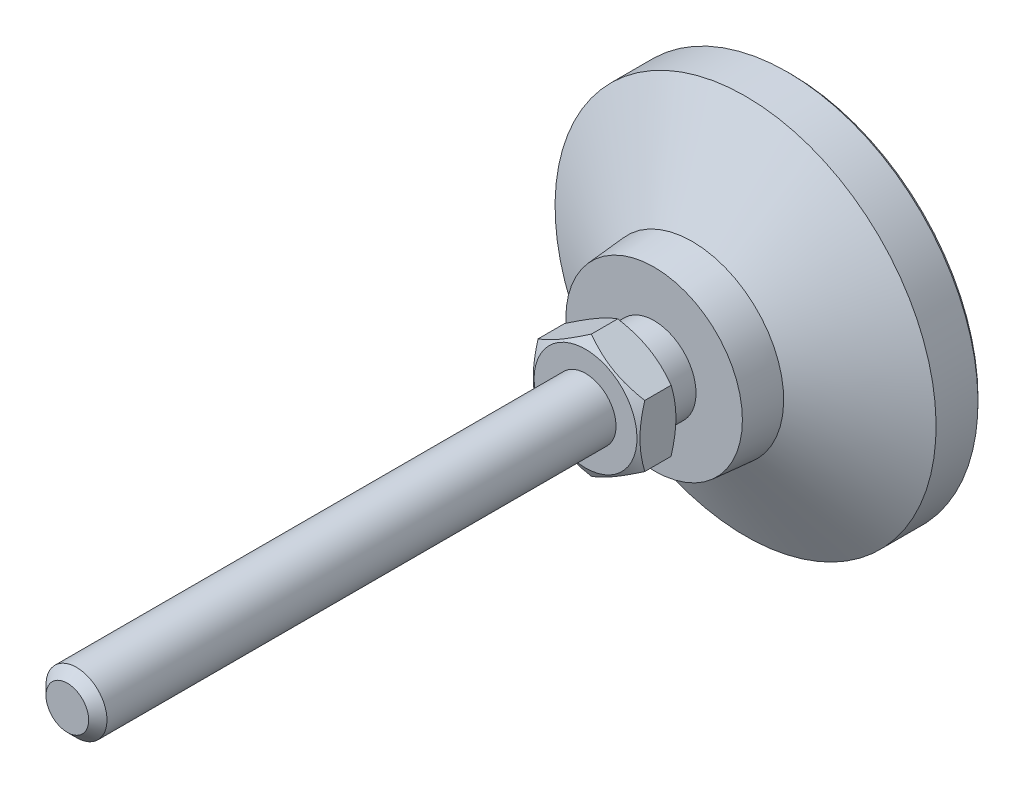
ISO-10303-21;
HEADER;
FILE_DESCRIPTION(('STEP AP214'),'2;1');
FILE_NAME('part.step','',(''),(''),'','','');
FILE_SCHEMA(('AUTOMOTIVE_DESIGN { 1 0 10303 214 1 1 1 1 }'));
ENDSEC;
DATA;
#1=APPLICATION_CONTEXT('core data for automotive mechanical design processes');
#2=APPLICATION_PROTOCOL_DEFINITION('international standard','automotive_design',2000,#1);
#3=PRODUCT_CONTEXT('',#1,'mechanical');
#4=PRODUCT('Part','Part','',(#3));
#5=PRODUCT_RELATED_PRODUCT_CATEGORY('part','',(#4));
#6=PRODUCT_DEFINITION_FORMATION('','',#4);
#7=PRODUCT_DEFINITION_CONTEXT('part definition',#1,'design');
#8=PRODUCT_DEFINITION('design','',#6,#7);
#9=PRODUCT_DEFINITION_SHAPE('','',#8);
#10=(LENGTH_UNIT() NAMED_UNIT(*) SI_UNIT(.MILLI.,.METRE.));
#11=(NAMED_UNIT(*) PLANE_ANGLE_UNIT() SI_UNIT($,.RADIAN.));
#12=(NAMED_UNIT(*) SI_UNIT($,.STERADIAN.) SOLID_ANGLE_UNIT());
#13=UNCERTAINTY_MEASURE_WITH_UNIT(LENGTH_MEASURE(1.E-05),#10,'distance_accuracy_value','');
#14=(GEOMETRIC_REPRESENTATION_CONTEXT(3) GLOBAL_UNCERTAINTY_ASSIGNED_CONTEXT((#13)) GLOBAL_UNIT_ASSIGNED_CONTEXT((#10,
#11,#12)) REPRESENTATION_CONTEXT('',''));
#15=CARTESIAN_POINT('',(0.,0.,0.));
#16=DIRECTION('',(0.,0.,1.));
#17=DIRECTION('',(1.,0.,0.));
#18=AXIS2_PLACEMENT_3D('',#15,#16,#17);
#19=CARTESIAN_POINT('',(0.,0.,-1.));
#20=DIRECTION('',(0.,0.,-1.));
#21=DIRECTION('',(0.,1.,0.));
#22=AXIS2_PLACEMENT_3D('',#19,#20,#21);
#23=CYLINDRICAL_SURFACE('',#22,5.49999999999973);
#24=CARTESIAN_POINT('',(0.,0.,22.));
#25=DIRECTION('',(0.,0.,-1.));
#26=DIRECTION('',(0.,1.,0.));
#27=AXIS2_PLACEMENT_3D('',#24,#25,#26);
#28=CIRCLE('',#27,5.49999999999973);
#29=CARTESIAN_POINT('',(0.,5.49999999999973,22.));
#30=VERTEX_POINT('',#29);
#31=EDGE_CURVE('E100',#30,#30,#28,.T.);
#32=ORIENTED_EDGE('',*,*,#31,.T.);
#33=EDGE_LOOP('',(#32));
#34=FACE_BOUND('',#33,.T.);
#35=CARTESIAN_POINT('',(0.,0.,18.));
#36=DIRECTION('',(0.,0.,-1.));
#37=DIRECTION('',(0.,1.,0.));
#38=AXIS2_PLACEMENT_3D('',#35,#36,#37);
#39=CIRCLE('',#38,5.49999999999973);
#40=CARTESIAN_POINT('',(0.,5.49999999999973,18.));
#41=VERTEX_POINT('',#40);
#42=EDGE_CURVE('E93',#41,#41,#39,.T.);
#43=ORIENTED_EDGE('',*,*,#42,.F.);
#44=EDGE_LOOP('',(#43));
#45=FACE_BOUND('',#44,.T.);
#46=ADVANCED_FACE('F14',(#34,#45),#23,.T.);
#47=CARTESIAN_POINT('',(-5.49999999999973,0.,22.));
#48=DIRECTION('',(0.,0.,1.));
#49=DIRECTION('',(0.,-1.,0.));
#50=AXIS2_PLACEMENT_3D('',#47,#48,#49);
#51=PLANE('',#50);
#52=CARTESIAN_POINT('',(0.,0.,22.));
#53=DIRECTION('',(0.,0.,1.));
#54=DIRECTION('',(0.,-1.,0.));
#55=AXIS2_PLACEMENT_3D('',#52,#53,#54);
#56=CIRCLE('',#55,6.75);
#57=CARTESIAN_POINT('',(0.,-6.75,22.));
#58=VERTEX_POINT('',#57);
#59=EDGE_CURVE('E417',#58,#58,#56,.T.);
#60=ORIENTED_EDGE('',*,*,#59,.F.);
#61=EDGE_LOOP('',(#60));
#62=FACE_BOUND('',#61,.T.);
#63=ORIENTED_EDGE('',*,*,#31,.F.);
#64=EDGE_LOOP('',(#63));
#65=FACE_BOUND('',#64,.T.);
#66=ADVANCED_FACE('F133',(#62,#65),#51,.F.);
#67=CARTESIAN_POINT('',(0.,-5.49999999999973,18.));
#68=DIRECTION('',(0.,0.,1.));
#69=DIRECTION('',(0.,-1.,0.));
#70=AXIS2_PLACEMENT_3D('',#67,#68,#69);
#71=PLANE('',#70);
#72=ORIENTED_EDGE('',*,*,#42,.T.);
#73=EDGE_LOOP('',(#72));
#74=FACE_BOUND('',#73,.T.);
#75=CARTESIAN_POINT('',(0.,0.,18.));
#76=DIRECTION('',(0.,0.,1.));
#77=DIRECTION('',(0.,-1.,0.));
#78=AXIS2_PLACEMENT_3D('',#75,#76,#77);
#79=CIRCLE('',#78,11.5833333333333);
#80=CARTESIAN_POINT('',(0.,-11.5833333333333,18.));
#81=VERTEX_POINT('',#80);
#82=EDGE_CURVE('E88',#81,#81,#79,.T.);
#83=ORIENTED_EDGE('',*,*,#82,.T.);
#84=EDGE_LOOP('',(#83));
#85=FACE_BOUND('',#84,.T.);
#86=ADVANCED_FACE('F124',(#74,#85),#71,.T.);
#87=CARTESIAN_POINT('',(0.,0.,0.));
#88=DIRECTION('',(0.,0.,-1.));
#89=DIRECTION('',(0.,1.,0.));
#90=AXIS2_PLACEMENT_3D('',#87,#88,#89);
#91=PLANE('',#90);
#92=CARTESIAN_POINT('',(0.,0.,0.));
#93=DIRECTION('',(0.,0.,-1.));
#94=DIRECTION('',(0.,1.,0.));
#95=AXIS2_PLACEMENT_3D('',#92,#93,#94);
#96=CIRCLE('',#95,24.5);
#97=CARTESIAN_POINT('',(0.,24.5,0.));
#98=VERTEX_POINT('',#97);
#99=EDGE_CURVE('E108',#98,#98,#96,.T.);
#100=ORIENTED_EDGE('',*,*,#99,.T.);
#101=EDGE_LOOP('',(#100));
#102=FACE_BOUND('',#101,.T.);
#103=ADVANCED_FACE('F122',(#102),#91,.T.);
#104=CARTESIAN_POINT('',(0.,0.,-1.));
#105=DIRECTION('',(0.,0.,-1.));
#106=DIRECTION('',(0.,1.,0.));
#107=AXIS2_PLACEMENT_3D('',#104,#105,#106);
#108=CYLINDRICAL_SURFACE('',#107,25.);
#109=CARTESIAN_POINT('',(0.,0.,0.500000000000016));
#110=DIRECTION('',(0.,0.,-1.));
#111=DIRECTION('',(0.,1.,0.));
#112=AXIS2_PLACEMENT_3D('',#109,#110,#111);
#113=CIRCLE('',#112,25.);
#114=CARTESIAN_POINT('',(0.,25.,0.500000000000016));
#115=VERTEX_POINT('',#114);
#116=EDGE_CURVE('E28',#115,#115,#113,.F.);
#117=ORIENTED_EDGE('',*,*,#116,.T.);
#118=EDGE_LOOP('',(#117));
#119=FACE_BOUND('',#118,.T.);
#120=CARTESIAN_POINT('',(0.,0.,6.00000000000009));
#121=DIRECTION('',(0.,0.,-1.));
#122=DIRECTION('',(0.,1.,0.));
#123=AXIS2_PLACEMENT_3D('',#120,#121,#122);
#124=CIRCLE('',#123,25.);
#125=CARTESIAN_POINT('',(0.,25.,6.00000000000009));
#126=VERTEX_POINT('',#125);
#127=EDGE_CURVE('E106',#126,#126,#124,.T.);
#128=ORIENTED_EDGE('',*,*,#127,.T.);
#129=EDGE_LOOP('',(#128));
#130=FACE_BOUND('',#129,.T.);
#131=ADVANCED_FACE('F114',(#119,#130),#108,.T.);
#132=CARTESIAN_POINT('',(0.,0.,13.));
#133=DIRECTION('',(0.,0.,-1.));
#134=DIRECTION('',(0.,1.,0.));
#135=AXIS2_PLACEMENT_3D('',#132,#133,#134);
#136=CONICAL_SURFACE('',#135,12.,1.07685495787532);
#137=ORIENTED_EDGE('',*,*,#127,.F.);
#138=EDGE_LOOP('',(#137));
#139=FACE_BOUND('',#138,.T.);
#140=CARTESIAN_POINT('',(0.,0.,13.));
#141=DIRECTION('',(0.,0.,-1.));
#142=DIRECTION('',(0.,1.,0.));
#143=AXIS2_PLACEMENT_3D('',#140,#141,#142);
#144=CIRCLE('',#143,12.);
#145=CARTESIAN_POINT('',(0.,12.,13.));
#146=VERTEX_POINT('',#145);
#147=EDGE_CURVE('E103',#146,#146,#144,.T.);
#148=ORIENTED_EDGE('',*,*,#147,.T.);
#149=EDGE_LOOP('',(#148));
#150=FACE_BOUND('',#149,.T.);
#151=ADVANCED_FACE('F132',(#139,#150),#136,.T.);
#152=CARTESIAN_POINT('',(0.,0.,19.));
#153=DIRECTION('',(0.,0.,-1.));
#154=DIRECTION('',(0.,1.,0.));
#155=AXIS2_PLACEMENT_3D('',#152,#153,#154);
#156=CONICAL_SURFACE('',#155,11.5,0.0831412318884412);
#157=ORIENTED_EDGE('',*,*,#147,.F.);
#158=EDGE_LOOP('',(#157));
#159=FACE_BOUND('',#158,.T.);
#160=ORIENTED_EDGE('',*,*,#82,.F.);
#161=EDGE_LOOP('',(#160));
#162=FACE_BOUND('',#161,.T.);
#163=ADVANCED_FACE('F119',(#159,#162),#156,.T.);
#164=CARTESIAN_POINT('',(0.,0.,0.));
#165=DIRECTION('',(0.,0.,1.));
#166=DIRECTION('',(0.,-1.,0.));
#167=AXIS2_PLACEMENT_3D('',#164,#165,#166);
#168=CONICAL_SURFACE('',#167,24.5,0.785398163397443);
#169=ORIENTED_EDGE('',*,*,#116,.F.);
#170=EDGE_LOOP('',(#169));
#171=FACE_BOUND('',#170,.T.);
#172=ORIENTED_EDGE('',*,*,#99,.F.);
#173=EDGE_LOOP('',(#172));
#174=FACE_BOUND('',#173,.T.);
#175=ADVANCED_FACE('F16',(#171,#174),#168,.T.);
#176=CARTESIAN_POINT('',(0.,0.,22.));
#177=DIRECTION('',(0.,0.,1.));
#178=DIRECTION('',(0.,-1.,0.));
#179=AXIS2_PLACEMENT_3D('',#176,#177,#178);
#180=CONICAL_SURFACE('',#179,6.75,1.0471975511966);
#181=CARTESIAN_POINT('',(0.000200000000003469,-8.0830192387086,22.7696190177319));
#182=CARTESIAN_POINT('',(-0.15366790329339,-7.99418356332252,22.7183374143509));
#183=CARTESIAN_POINT('',(-0.308109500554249,-7.90501666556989,22.669383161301));
#184=CARTESIAN_POINT('',(-0.618246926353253,-7.72595873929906,22.5767703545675));
#185=CARTESIAN_POINT('',(-0.773943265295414,-7.63606741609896,22.5331140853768));
#186=CARTESIAN_POINT('',(-1.24352516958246,-7.36495417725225,22.4109491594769));
#187=CARTESIAN_POINT('',(-1.5592643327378,-7.18266208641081,22.3414631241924));
#188=CARTESIAN_POINT('',(-2.03176224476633,-6.90986528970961,22.2599825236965));
#189=CARTESIAN_POINT('',(-2.18710922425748,-6.82017566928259,22.2367710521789));
#190=CARTESIAN_POINT('',(-2.49850511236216,-6.64039116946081,22.1978487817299));
#191=CARTESIAN_POINT('',(-2.65455395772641,-6.55029632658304,22.1821373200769));
#192=CARTESIAN_POINT('',(-2.96692267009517,-6.36995016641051,22.1586154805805));
#193=CARTESIAN_POINT('',(-3.12324202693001,-6.27969914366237,22.1507961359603));
#194=CARTESIAN_POINT('',(-3.43601650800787,-6.09911871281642,22.1432178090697));
#195=CARTESIAN_POINT('',(-3.59247162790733,-6.00878930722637,22.1434585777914));
#196=CARTESIAN_POINT('',(-4.02110687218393,-5.76131663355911,22.155197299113));
#197=CARTESIAN_POINT('',(-4.2931466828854,-5.60425437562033,22.1749033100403));
#198=CARTESIAN_POINT('',(-4.83541944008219,-5.29117305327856,22.2373910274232));
#199=CARTESIAN_POINT('',(-5.10565047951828,-5.13515508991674,22.2801940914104));
#200=CARTESIAN_POINT('',(-5.64901454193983,-4.82144370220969,22.3871892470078));
#201=CARTESIAN_POINT('',(-5.92207900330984,-4.6637898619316,22.4518346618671));
#202=CARTESIAN_POINT('',(-6.46413578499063,-4.35083323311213,22.5985536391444));
#203=CARTESIAN_POINT('',(-6.73313504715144,-4.19552643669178,22.680592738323));
#204=CARTESIAN_POINT('',(-7.0002,-4.04133641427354,22.7696190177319));
#205=B_SPLINE_CURVE_WITH_KNOTS('',3,(#181,#182,#183,#184,#185,#186,#187,#188,#189,#190,#191,
#192,#193,#194,#195,#196,#197,#198,#199,#200,#201,#202,#203,#204),.UNSPECIFIED.,.F.,.F.,(4,2,2,
2,2,2,2,2,2,2,2,4),(0.,0.554727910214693,1.10969417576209,2.2219327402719,2.76443041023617,
3.30688013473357,3.8487128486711,4.39052882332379,5.33376515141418,6.27787517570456,
7.2429241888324,8.20607866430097),.UNSPECIFIED.);
#206=CARTESIAN_POINT('',(0.,-8.08290376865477,22.7695523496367));
#207=VERTEX_POINT('',#206);
#208=CARTESIAN_POINT('',(-7.,-4.04145188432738,22.7695523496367));
#209=VERTEX_POINT('',#208);
#210=EDGE_CURVE('E73',#207,#209,#205,.T.);
#211=ORIENTED_EDGE('',*,*,#210,.T.);
#212=CARTESIAN_POINT('',(-7.,10.8083509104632,25.5374995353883));
#213=CARTESIAN_POINT('',(-7.,10.5030085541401,25.3895726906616));
#214=CARTESIAN_POINT('',(-7.,10.1969601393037,25.2430780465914));
#215=CARTESIAN_POINT('',(-7.,9.58307551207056,24.9537596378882));
#216=CARTESIAN_POINT('',(-7.,9.27523902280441,24.8109364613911));
#217=CARTESIAN_POINT('',(-7.,8.65579360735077,24.5290387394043));
#218=CARTESIAN_POINT('',(-7.,8.3441732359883,24.3899892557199));
#219=CARTESIAN_POINT('',(-7.,7.71843731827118,24.1176445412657));
#220=CARTESIAN_POINT('',(-7.,7.40432189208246,23.9843490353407));
#221=CARTESIAN_POINT('',(-7.,6.76314461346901,23.720944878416));
#222=CARTESIAN_POINT('',(-7.,6.4359866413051,23.5910688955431));
#223=CARTESIAN_POINT('',(-7.,5.77782647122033,23.3412618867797));
#224=CARTESIAN_POINT('',(-7.,5.44682384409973,23.2213319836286));
#225=CARTESIAN_POINT('',(-7.,4.78107879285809,22.9946007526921));
#226=CARTESIAN_POINT('',(-7.,4.44634566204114,22.8877724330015));
#227=CARTESIAN_POINT('',(-7.,3.77209045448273,22.6907020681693));
#228=CARTESIAN_POINT('',(-7.,3.43256993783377,22.6004547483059));
#229=CARTESIAN_POINT('',(-7.,2.75036420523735,22.4413917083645));
#230=CARTESIAN_POINT('',(-7.,2.40770639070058,22.3724616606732));
#231=CARTESIAN_POINT('',(-7.,1.89063767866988,22.2880627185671));
#232=CARTESIAN_POINT('',(-7.,1.71775471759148,22.2630946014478));
#233=CARTESIAN_POINT('',(-7.,1.37114572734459,22.2199811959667));
#234=CARTESIAN_POINT('',(-7.,1.19741978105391,22.2018352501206));
#235=CARTESIAN_POINT('',(-7.,0.851606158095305,22.1729528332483));
#236=CARTESIAN_POINT('',(-7.,0.679526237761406,22.162123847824));
#237=CARTESIAN_POINT('',(-7.,0.335062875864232,22.1477491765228));
#238=CARTESIAN_POINT('',(-7.,0.162679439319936,22.1442033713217));
#239=CARTESIAN_POINT('',(-7.,-0.182083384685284,22.1444795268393));
#240=CARTESIAN_POINT('',(-7.,-0.354462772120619,22.1483015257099));
#241=CARTESIAN_POINT('',(-7.,-0.698908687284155,22.1632207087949));
#242=CARTESIAN_POINT('',(-7.,-0.870975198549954,22.174318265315));
#243=CARTESIAN_POINT('',(-7.,-1.2859534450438,22.2096229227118));
#244=CARTESIAN_POINT('',(-7.,-1.52857083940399,22.2373624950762));
#245=CARTESIAN_POINT('',(-7.,-2.01196215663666,22.3057820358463));
#246=CARTESIAN_POINT('',(-7.,-2.25273581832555,22.3464638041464));
#247=CARTESIAN_POINT('',(-7.,-2.97203992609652,22.4857615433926));
#248=CARTESIAN_POINT('',(-7.,-3.44727623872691,22.6016032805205));
#249=CARTESIAN_POINT('',(-7.,-4.15782038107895,22.8019447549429));
#250=CARTESIAN_POINT('',(-7.,-4.39682721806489,22.8740752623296));
#251=CARTESIAN_POINT('',(-7.,-4.87251857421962,23.0256937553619));
#252=CARTESIAN_POINT('',(-7.,-5.10920307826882,23.1051817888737));
#253=CARTESIAN_POINT('',(-7.,-5.58032684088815,23.2702511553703));
#254=CARTESIAN_POINT('',(-7.,-5.81476684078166,23.3558303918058));
#255=CARTESIAN_POINT('',(-7.,-6.28171349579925,23.5320886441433));
#256=CARTESIAN_POINT('',(-7.,-6.51422017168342,23.6227676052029));
#257=CARTESIAN_POINT('',(-7.,-7.05514478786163,23.8394761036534));
#258=CARTESIAN_POINT('',(-7.,-7.36289465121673,23.9671699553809));
#259=CARTESIAN_POINT('',(-7.,-7.97584454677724,24.228554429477));
#260=CARTESIAN_POINT('',(-7.,-8.28104443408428,24.3622453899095));
#261=CARTESIAN_POINT('',(-7.,-8.88935325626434,24.6344414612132));
#262=CARTESIAN_POINT('',(-7.,-9.19246178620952,24.7729474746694));
#263=CARTESIAN_POINT('',(-7.,-9.79688426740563,25.053828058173));
#264=CARTESIAN_POINT('',(-7.,-10.0981981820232,25.1962027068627));
#265=CARTESIAN_POINT('',(-7.,-10.699619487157,25.4842502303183));
#266=CARTESIAN_POINT('',(-7.,-10.9997253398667,25.629926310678));
#267=CARTESIAN_POINT('',(-7.,-11.5986589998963,25.9238848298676));
#268=CARTESIAN_POINT('',(-7.,-11.8974867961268,26.0721672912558));
#269=CARTESIAN_POINT('',(-7.,-12.7922789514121,26.5202050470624));
#270=CARTESIAN_POINT('',(-7.,-13.3866274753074,26.823187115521));
#271=CARTESIAN_POINT('',(-7.,-14.5237560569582,27.4102386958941));
#272=CARTESIAN_POINT('',(-7.,-15.0667831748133,27.6938317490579));
#273=CARTESIAN_POINT('',(-7.,-16.150813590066,28.2649001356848));
#274=CARTESIAN_POINT('',(-7.,-16.6918168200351,28.5523755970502));
#275=CARTESIAN_POINT('',(-7.,-17.7709517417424,29.1296028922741));
#276=CARTESIAN_POINT('',(-7.,-18.3090872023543,29.4193476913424));
#277=CARTESIAN_POINT('',(-7.,-19.3840595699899,30.0011698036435));
#278=CARTESIAN_POINT('',(-7.,-19.9208965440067,30.2932469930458));
#279=CARTESIAN_POINT('',(-7.,-20.457253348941,30.5861974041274));
#280=B_SPLINE_CURVE_WITH_KNOTS('',3,(#212,#213,#214,#215,#216,#217,#218,#219,#220,#221,#222,
#223,#224,#225,#226,#227,#228,#229,#230,#231,#232,#233,#234,#235,#236,#237,#238,#239,#240,#241,
#242,#243,#244,#245,#246,#247,#248,#249,#250,#251,#252,#253,#254,#255,#256,#257,#258,#259,#260,
#261,#262,#263,#264,#265,#266,#267,#268,#269,#270,#271,#272,#273,#274,#275,#276,#277,#278,#279),
.UNSPECIFIED.,.F.,.F.,(4,2,2,2,2,2,2,2,2,2,2,2,2,2,2,2,2,2,2,2,2,2,2,2,2,2,2,2,2,2,2,2,2,4),(0.,
1.01787647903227,2.03591500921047,3.05957645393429,4.08318889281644,5.13904686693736,
6.19502386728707,7.24878743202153,8.30221519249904,9.34989116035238,9.87380759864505,
10.3976735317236,10.9147852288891,11.4318884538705,11.9489943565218,12.4661267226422,
13.1983061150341,13.9305873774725,15.3959817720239,16.1448827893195,16.8937886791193,
17.6424380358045,18.3910793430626,19.3905650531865,20.3901071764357,21.3898376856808,
22.389588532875,23.3903556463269,24.3911314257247,26.3924318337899,28.2302755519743,
30.0681799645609,31.9017158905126,33.7351551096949),.UNSPECIFIED.);
#281=CARTESIAN_POINT('',(-7.,4.04145188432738,22.7695523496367));
#282=VERTEX_POINT('',#281);
#283=EDGE_CURVE('E81',#209,#282,#280,.F.);
#284=ORIENTED_EDGE('',*,*,#283,.T.);
#285=CARTESIAN_POINT('',(-7.0002,4.04133641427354,22.7696190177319));
#286=CARTESIAN_POINT('',(-6.84633209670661,4.13017208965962,22.7183374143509));
#287=CARTESIAN_POINT('',(-6.69189049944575,4.21933898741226,22.669383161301));
#288=CARTESIAN_POINT('',(-6.38175307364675,4.39839691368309,22.5767703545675));
#289=CARTESIAN_POINT('',(-6.22605673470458,4.48828823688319,22.5331140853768));
#290=CARTESIAN_POINT('',(-5.75647483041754,4.75940147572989,22.4109491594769));
#291=CARTESIAN_POINT('',(-5.4407356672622,4.94169356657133,22.3414631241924));
#292=CARTESIAN_POINT('',(-4.96823775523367,5.21449036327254,22.2599825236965));
#293=CARTESIAN_POINT('',(-4.81289077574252,5.30417998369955,22.2367710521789));
#294=CARTESIAN_POINT('',(-4.50149488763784,5.48396448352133,22.1978487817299));
#295=CARTESIAN_POINT('',(-4.34544604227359,5.57405932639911,22.1821373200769));
#296=CARTESIAN_POINT('',(-4.03307732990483,5.75440548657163,22.1586154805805));
#297=CARTESIAN_POINT('',(-3.87675797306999,5.84465650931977,22.1507961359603));
#298=CARTESIAN_POINT('',(-3.56398349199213,6.02523694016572,22.1432178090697));
#299=CARTESIAN_POINT('',(-3.40752837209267,6.11556634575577,22.1434585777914));
#300=CARTESIAN_POINT('',(-2.97889312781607,6.36303901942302,22.155197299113));
#301=CARTESIAN_POINT('',(-2.7068533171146,6.52010127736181,22.1749033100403));
#302=CARTESIAN_POINT('',(-2.16458055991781,6.83318259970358,22.2373910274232));
#303=CARTESIAN_POINT('',(-1.89434952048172,6.9892005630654,22.2801940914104));
#304=CARTESIAN_POINT('',(-1.35098545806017,7.30291195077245,22.3871892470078));
#305=CARTESIAN_POINT('',(-1.07792099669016,7.46056579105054,22.4518346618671));
#306=CARTESIAN_POINT('',(-0.535864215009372,7.77352241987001,22.5985536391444));
#307=CARTESIAN_POINT('',(-0.266864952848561,7.92882921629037,22.680592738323));
#308=CARTESIAN_POINT('',(0.000199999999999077,8.0830192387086,22.7696190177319));
#309=B_SPLINE_CURVE_WITH_KNOTS('',3,(#285,#286,#287,#288,#289,#290,#291,#292,#293,#294,#295,
#296,#297,#298,#299,#300,#301,#302,#303,#304,#305,#306,#307,#308),.UNSPECIFIED.,.F.,.F.,(4,2,2,
2,2,2,2,2,2,2,2,4),(0.,0.554727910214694,1.10969417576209,2.2219327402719,2.76443041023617,
3.30688013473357,3.84871284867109,4.39052882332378,5.33376515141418,6.27787517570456,
7.2429241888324,8.20607866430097),.UNSPECIFIED.);
#310=CARTESIAN_POINT('',(0.,8.08290376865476,22.7695523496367));
#311=VERTEX_POINT('',#310);
#312=EDGE_CURVE('E361',#282,#311,#309,.T.);
#313=ORIENTED_EDGE('',*,*,#312,.T.);
#314=CARTESIAN_POINT('',(-0.000200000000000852,8.0830192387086,22.7696190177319));
#315=CARTESIAN_POINT('',(0.153667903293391,7.99418356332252,22.7183374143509));
#316=CARTESIAN_POINT('',(0.308109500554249,7.90501666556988,22.669383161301));
#317=CARTESIAN_POINT('',(0.618246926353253,7.72595873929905,22.5767703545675));
#318=CARTESIAN_POINT('',(0.773943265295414,7.63606741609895,22.5331140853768));
#319=CARTESIAN_POINT('',(1.24352516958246,7.36495417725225,22.4109491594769));
#320=CARTESIAN_POINT('',(1.5592643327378,7.18266208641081,22.3414631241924));
#321=CARTESIAN_POINT('',(2.03176224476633,6.9098652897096,22.2599825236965));
#322=CARTESIAN_POINT('',(2.18710922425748,6.82017566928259,22.2367710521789));
#323=CARTESIAN_POINT('',(2.49850511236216,6.64039116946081,22.1978487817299));
#324=CARTESIAN_POINT('',(2.65455395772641,6.55029632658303,22.1821373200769));
#325=CARTESIAN_POINT('',(2.96692267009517,6.36995016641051,22.1586154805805));
#326=CARTESIAN_POINT('',(3.12324202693,6.27969914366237,22.1507961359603));
#327=CARTESIAN_POINT('',(3.43601650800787,6.09911871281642,22.1432178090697));
#328=CARTESIAN_POINT('',(3.59247162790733,6.00878930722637,22.1434585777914));
#329=CARTESIAN_POINT('',(4.02110687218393,5.76131663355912,22.155197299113));
#330=CARTESIAN_POINT('',(4.2931466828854,5.60425437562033,22.1749033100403));
#331=CARTESIAN_POINT('',(4.83541944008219,5.29117305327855,22.2373910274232));
#332=CARTESIAN_POINT('',(5.10565047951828,5.13515508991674,22.2801940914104));
#333=CARTESIAN_POINT('',(5.64901454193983,4.82144370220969,22.3871892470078));
#334=CARTESIAN_POINT('',(5.92207900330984,4.66378986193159,22.4518346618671));
#335=CARTESIAN_POINT('',(6.46413578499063,4.35083323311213,22.5985536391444));
#336=CARTESIAN_POINT('',(6.73313504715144,4.19552643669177,22.680592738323));
#337=CARTESIAN_POINT('',(7.0002,4.04133641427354,22.7696190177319));
#338=B_SPLINE_CURVE_WITH_KNOTS('',3,(#314,#315,#316,#317,#318,#319,#320,#321,#322,#323,#324,
#325,#326,#327,#328,#329,#330,#331,#332,#333,#334,#335,#336,#337),.UNSPECIFIED.,.F.,.F.,(4,2,2,
2,2,2,2,2,2,2,2,4),(0.,0.554727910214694,1.10969417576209,2.2219327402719,2.76443041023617,
3.30688013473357,3.8487128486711,4.39052882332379,5.33376515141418,6.27787517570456,
7.2429241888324,8.20607866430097),.UNSPECIFIED.);
#339=CARTESIAN_POINT('',(7.,4.04145188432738,22.7695523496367));
#340=VERTEX_POINT('',#339);
#341=EDGE_CURVE('E356',#311,#340,#338,.T.);
#342=ORIENTED_EDGE('',*,*,#341,.T.);
#343=CARTESIAN_POINT('',(7.,10.8083509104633,25.5374995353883));
#344=CARTESIAN_POINT('',(7.,10.5030085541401,25.3895726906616));
#345=CARTESIAN_POINT('',(7.,10.1969601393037,25.2430780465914));
#346=CARTESIAN_POINT('',(7.,9.58307551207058,24.9537596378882));
#347=CARTESIAN_POINT('',(7.,9.27523902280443,24.8109364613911));
#348=CARTESIAN_POINT('',(7.,8.65579360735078,24.5290387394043));
#349=CARTESIAN_POINT('',(7.,8.34417323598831,24.3899892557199));
#350=CARTESIAN_POINT('',(7.,7.71843731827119,24.1176445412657));
#351=CARTESIAN_POINT('',(7.,7.40432189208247,23.9843490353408));
#352=CARTESIAN_POINT('',(7.,6.76314461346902,23.720944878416));
#353=CARTESIAN_POINT('',(7.,6.43598664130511,23.5910688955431));
#354=CARTESIAN_POINT('',(7.,5.77782647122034,23.3412618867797));
#355=CARTESIAN_POINT('',(7.,5.44682384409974,23.2213319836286));
#356=CARTESIAN_POINT('',(7.,4.78107879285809,22.9946007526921));
#357=CARTESIAN_POINT('',(7.,4.44634566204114,22.8877724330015));
#358=CARTESIAN_POINT('',(7.,3.77209045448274,22.6907020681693));
#359=CARTESIAN_POINT('',(7.,3.43256993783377,22.6004547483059));
#360=CARTESIAN_POINT('',(7.,2.75036420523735,22.4413917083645));
#361=CARTESIAN_POINT('',(7.,2.40770639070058,22.3724616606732));
#362=CARTESIAN_POINT('',(7.,1.89063767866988,22.2880627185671));
#363=CARTESIAN_POINT('',(7.,1.71775471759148,22.2630946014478));
#364=CARTESIAN_POINT('',(7.,1.37114572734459,22.2199811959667));
#365=CARTESIAN_POINT('',(7.,1.19741978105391,22.2018352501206));
#366=CARTESIAN_POINT('',(7.,0.851606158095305,22.1729528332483));
#367=CARTESIAN_POINT('',(7.,0.679526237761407,22.162123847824));
#368=CARTESIAN_POINT('',(7.,0.335062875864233,22.1477491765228));
#369=CARTESIAN_POINT('',(7.,0.162679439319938,22.1442033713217));
#370=CARTESIAN_POINT('',(7.,-0.182083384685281,22.1444795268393));
#371=CARTESIAN_POINT('',(7.,-0.354462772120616,22.1483015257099));
#372=CARTESIAN_POINT('',(7.,-0.698908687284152,22.1632207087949));
#373=CARTESIAN_POINT('',(7.,-0.870975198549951,22.174318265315));
#374=CARTESIAN_POINT('',(7.,-1.2859534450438,22.2096229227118));
#375=CARTESIAN_POINT('',(7.,-1.52857083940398,22.2373624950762));
#376=CARTESIAN_POINT('',(7.,-2.01196215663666,22.3057820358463));
#377=CARTESIAN_POINT('',(7.,-2.25273581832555,22.3464638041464));
#378=CARTESIAN_POINT('',(7.,-2.97203992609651,22.4857615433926));
#379=CARTESIAN_POINT('',(7.,-3.44727623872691,22.6016032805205));
#380=CARTESIAN_POINT('',(7.,-4.15782038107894,22.8019447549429));
#381=CARTESIAN_POINT('',(7.,-4.39682721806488,22.8740752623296));
#382=CARTESIAN_POINT('',(7.,-4.87251857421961,23.0256937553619));
#383=CARTESIAN_POINT('',(7.,-5.10920307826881,23.1051817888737));
#384=CARTESIAN_POINT('',(7.,-5.58032684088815,23.2702511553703));
#385=CARTESIAN_POINT('',(7.,-5.81476684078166,23.3558303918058));
#386=CARTESIAN_POINT('',(7.,-6.28171349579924,23.5320886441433));
#387=CARTESIAN_POINT('',(7.,-6.51422017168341,23.6227676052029));
#388=CARTESIAN_POINT('',(7.,-7.05514478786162,23.8394761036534));
#389=CARTESIAN_POINT('',(7.,-7.36289465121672,23.9671699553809));
#390=CARTESIAN_POINT('',(7.,-7.97584454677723,24.228554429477));
#391=CARTESIAN_POINT('',(7.,-8.28104443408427,24.3622453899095));
#392=CARTESIAN_POINT('',(7.,-8.88935325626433,24.6344414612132));
#393=CARTESIAN_POINT('',(7.,-9.1924617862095,24.7729474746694));
#394=CARTESIAN_POINT('',(7.,-9.79688426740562,25.053828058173));
#395=CARTESIAN_POINT('',(7.,-10.0981981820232,25.1962027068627));
#396=CARTESIAN_POINT('',(7.,-10.699619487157,25.4842502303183));
#397=CARTESIAN_POINT('',(7.,-10.9997253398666,25.629926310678));
#398=CARTESIAN_POINT('',(7.,-11.5986589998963,25.9238848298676));
#399=CARTESIAN_POINT('',(7.,-11.8974867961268,26.0721672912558));
#400=CARTESIAN_POINT('',(7.,-12.792278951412,26.5202050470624));
#401=CARTESIAN_POINT('',(7.,-13.3866274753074,26.823187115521));
#402=CARTESIAN_POINT('',(7.,-14.5237560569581,27.4102386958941));
#403=CARTESIAN_POINT('',(7.,-15.0667831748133,27.6938317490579));
#404=CARTESIAN_POINT('',(7.,-16.150813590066,28.2649001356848));
#405=CARTESIAN_POINT('',(7.,-16.6918168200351,28.5523755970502));
#406=CARTESIAN_POINT('',(7.,-17.7709517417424,29.1296028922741));
#407=CARTESIAN_POINT('',(7.,-18.3090872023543,29.4193476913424));
#408=CARTESIAN_POINT('',(7.,-19.3840595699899,30.0011698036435));
#409=CARTESIAN_POINT('',(7.,-19.9208965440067,30.2932469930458));
#410=CARTESIAN_POINT('',(7.,-20.457253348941,30.5861974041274));
#411=B_SPLINE_CURVE_WITH_KNOTS('',3,(#343,#344,#345,#346,#347,#348,#349,#350,#351,#352,#353,
#354,#355,#356,#357,#358,#359,#360,#361,#362,#363,#364,#365,#366,#367,#368,#369,#370,#371,#372,
#373,#374,#375,#376,#377,#378,#379,#380,#381,#382,#383,#384,#385,#386,#387,#388,#389,#390,#391,
#392,#393,#394,#395,#396,#397,#398,#399,#400,#401,#402,#403,#404,#405,#406,#407,#408,#409,#410),
.UNSPECIFIED.,.F.,.F.,(4,2,2,2,2,2,2,2,2,2,2,2,2,2,2,2,2,2,2,2,2,2,2,2,2,2,2,2,2,2,2,2,2,4),(0.,
1.01787647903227,2.03591500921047,3.05957645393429,4.08318889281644,5.13904686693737,
6.19502386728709,7.24878743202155,8.30221519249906,9.3498911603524,9.87380759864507,
10.3976735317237,10.9147852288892,11.4318884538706,11.9489943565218,12.4661267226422,
13.1983061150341,13.9305873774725,15.395981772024,16.1448827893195,16.8937886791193,
17.6424380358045,18.3910793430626,19.3905650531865,20.3901071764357,21.3898376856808,
22.389588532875,23.3903556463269,24.3911314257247,26.3924318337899,28.2302755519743,
30.0681799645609,31.9017158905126,33.735155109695),.UNSPECIFIED.);
#412=CARTESIAN_POINT('',(7.,-4.04145188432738,22.7695523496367));
#413=VERTEX_POINT('',#412);
#414=EDGE_CURVE('E34',#340,#413,#411,.T.);
#415=ORIENTED_EDGE('',*,*,#414,.T.);
#416=CARTESIAN_POINT('',(7.0002,-4.04133641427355,22.7696190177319));
#417=CARTESIAN_POINT('',(6.84633209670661,-4.13017208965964,22.7183374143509));
#418=CARTESIAN_POINT('',(6.69189049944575,-4.21933898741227,22.669383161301));
#419=CARTESIAN_POINT('',(6.38175307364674,-4.3983969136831,22.5767703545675));
#420=CARTESIAN_POINT('',(6.22605673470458,-4.4882882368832,22.5331140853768));
#421=CARTESIAN_POINT('',(5.75647483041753,-4.7594014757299,22.4109491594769));
#422=CARTESIAN_POINT('',(5.4407356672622,-4.94169356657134,22.3414631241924));
#423=CARTESIAN_POINT('',(4.96823775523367,-5.21449036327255,22.2599825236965));
#424=CARTESIAN_POINT('',(4.81289077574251,-5.30417998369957,22.2367710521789));
#425=CARTESIAN_POINT('',(4.50149488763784,-5.48396448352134,22.1978487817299));
#426=CARTESIAN_POINT('',(4.34544604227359,-5.57405932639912,22.1821373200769));
#427=CARTESIAN_POINT('',(4.03307732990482,-5.75440548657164,22.1586154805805));
#428=CARTESIAN_POINT('',(3.87675797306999,-5.84465650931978,22.1507961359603));
#429=CARTESIAN_POINT('',(3.56398349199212,-6.02523694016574,22.1432178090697));
#430=CARTESIAN_POINT('',(3.40752837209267,-6.11556634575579,22.1434585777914));
#431=CARTESIAN_POINT('',(2.97889312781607,-6.36303901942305,22.155197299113));
#432=CARTESIAN_POINT('',(2.7068533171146,-6.52010127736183,22.1749033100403));
#433=CARTESIAN_POINT('',(2.1645805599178,-6.83318259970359,22.2373910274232));
#434=CARTESIAN_POINT('',(1.89434952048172,-6.98920056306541,22.2801940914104));
#435=CARTESIAN_POINT('',(1.35098545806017,-7.30291195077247,22.3871892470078));
#436=CARTESIAN_POINT('',(1.07792099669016,-7.46056579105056,22.4518346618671));
#437=CARTESIAN_POINT('',(0.535864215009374,-7.77352241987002,22.5985536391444));
#438=CARTESIAN_POINT('',(0.266864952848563,-7.92882921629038,22.680592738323));
#439=CARTESIAN_POINT('',(-0.000199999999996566,-8.08301923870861,22.7696190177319));
#440=B_SPLINE_CURVE_WITH_KNOTS('',3,(#416,#417,#418,#419,#420,#421,#422,#423,#424,#425,#426,
#427,#428,#429,#430,#431,#432,#433,#434,#435,#436,#437,#438,#439),.UNSPECIFIED.,.F.,.F.,(4,2,2,
2,2,2,2,2,2,2,2,4),(0.,0.554727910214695,1.10969417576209,2.2219327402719,2.76443041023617,
3.30688013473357,3.8487128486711,4.39052882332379,5.33376515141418,6.27787517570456,
7.24292418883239,8.20607866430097),.UNSPECIFIED.);
#441=EDGE_CURVE('E9',#413,#207,#440,.T.);
#442=ORIENTED_EDGE('',*,*,#441,.T.);
#443=EDGE_LOOP('',(#211,#284,#313,#342,#415,#442));
#444=FACE_BOUND('',#443,.T.);
#445=ORIENTED_EDGE('',*,*,#59,.T.);
#446=EDGE_LOOP('',(#445));
#447=FACE_BOUND('',#446,.T.);
#448=ADVANCED_FACE('F71',(#444,#447),#180,.T.);
#449=CARTESIAN_POINT('',(0.,0.,95.));
#450=DIRECTION('',(0.,0.,-1.));
#451=DIRECTION('',(0.,1.,0.));
#452=AXIS2_PLACEMENT_3D('',#449,#450,#451);
#453=PLANE('',#452);
#454=CARTESIAN_POINT('',(0.,0.,95.));
#455=DIRECTION('',(0.,0.,-1.));
#456=DIRECTION('',(0.,1.,0.));
#457=AXIS2_PLACEMENT_3D('',#454,#455,#456);
#458=CIRCLE('',#457,2.79999999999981);
#459=CARTESIAN_POINT('',(0.,2.79999999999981,95.));
#460=VERTEX_POINT('',#459);
#461=EDGE_CURVE('E393',#460,#460,#458,.T.);
#462=ORIENTED_EDGE('',*,*,#461,.F.);
#463=EDGE_LOOP('',(#462));
#464=FACE_BOUND('',#463,.T.);
#465=ADVANCED_FACE('F187',(#464),#453,.F.);
#466=CARTESIAN_POINT('',(0.,0.,95.));
#467=DIRECTION('',(0.,0.,-1.));
#468=DIRECTION('',(0.,1.,0.));
#469=AXIS2_PLACEMENT_3D('',#466,#467,#468);
#470=CONICAL_SURFACE('',#469,2.79999999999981,0.785398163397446);
#471=CARTESIAN_POINT('',(0.,0.,93.8));
#472=DIRECTION('',(0.,0.,-1.));
#473=DIRECTION('',(0.,1.,0.));
#474=AXIS2_PLACEMENT_3D('',#471,#472,#473);
#475=CIRCLE('',#474,3.99999999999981);
#476=CARTESIAN_POINT('',(0.,3.99999999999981,93.8));
#477=VERTEX_POINT('',#476);
#478=EDGE_CURVE('E391',#477,#477,#475,.T.);
#479=ORIENTED_EDGE('',*,*,#478,.F.);
#480=EDGE_LOOP('',(#479));
#481=FACE_BOUND('',#480,.T.);
#482=ORIENTED_EDGE('',*,*,#461,.T.);
#483=EDGE_LOOP('',(#482));
#484=FACE_BOUND('',#483,.T.);
#485=ADVANCED_FACE('F194',(#481,#484),#470,.T.);
#486=CARTESIAN_POINT('',(0.,0.,-1.));
#487=DIRECTION('',(0.,0.,-1.));
#488=DIRECTION('',(0.,1.,0.));
#489=AXIS2_PLACEMENT_3D('',#486,#487,#488);
#490=CYLINDRICAL_SURFACE('',#489,3.99999999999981);
#491=CARTESIAN_POINT('',(0.,0.,27.));
#492=DIRECTION('',(0.,0.,-1.));
#493=DIRECTION('',(0.,1.,0.));
#494=AXIS2_PLACEMENT_3D('',#491,#492,#493);
#495=CIRCLE('',#494,3.99999999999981);
#496=CARTESIAN_POINT('',(0.,3.99999999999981,27.));
#497=VERTEX_POINT('',#496);
#498=EDGE_CURVE('E97',#497,#497,#495,.T.);
#499=ORIENTED_EDGE('',*,*,#498,.F.);
#500=EDGE_LOOP('',(#499));
#501=FACE_BOUND('',#500,.T.);
#502=ORIENTED_EDGE('',*,*,#478,.T.);
#503=EDGE_LOOP('',(#502));
#504=FACE_BOUND('',#503,.T.);
#505=ADVANCED_FACE('F203',(#501,#504),#490,.T.);
#506=CARTESIAN_POINT('',(-3.99999999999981,0.,27.));
#507=DIRECTION('',(0.,0.,-1.));
#508=DIRECTION('',(0.,1.,0.));
#509=AXIS2_PLACEMENT_3D('',#506,#507,#508);
#510=PLANE('',#509);
#511=CARTESIAN_POINT('',(0.,0.,27.));
#512=DIRECTION('',(0.,0.,1.));
#513=DIRECTION('',(0.,-1.,0.));
#514=AXIS2_PLACEMENT_3D('',#511,#512,#513);
#515=CIRCLE('',#514,6.75);
#516=CARTESIAN_POINT('',(0.,-6.75,27.));
#517=VERTEX_POINT('',#516);
#518=EDGE_CURVE('E80',#517,#517,#515,.T.);
#519=ORIENTED_EDGE('',*,*,#518,.T.);
#520=EDGE_LOOP('',(#519));
#521=FACE_BOUND('',#520,.T.);
#522=ORIENTED_EDGE('',*,*,#498,.T.);
#523=EDGE_LOOP('',(#522));
#524=FACE_BOUND('',#523,.T.);
#525=ADVANCED_FACE('F212',(#521,#524),#510,.F.);
#526=CARTESIAN_POINT('',(0.,0.,25.4403702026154));
#527=DIRECTION('',(0.,0.,-1.));
#528=DIRECTION('',(0.,1.,0.));
#529=AXIS2_PLACEMENT_3D('',#526,#527,#528);
#530=CONICAL_SURFACE('',#529,9.45135805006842,1.0471975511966);
#531=CARTESIAN_POINT('',(-7.0002,-4.04133641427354,26.2303809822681));
#532=CARTESIAN_POINT('',(-6.84633209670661,-4.13017208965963,26.2816625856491));
#533=CARTESIAN_POINT('',(-6.69189049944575,-4.21933898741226,26.330616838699));
#534=CARTESIAN_POINT('',(-6.38175307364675,-4.39839691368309,26.4232296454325));
#535=CARTESIAN_POINT('',(-6.22605673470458,-4.48828823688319,26.4668859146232));
#536=CARTESIAN_POINT('',(-5.75647483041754,-4.7594014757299,26.5890508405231));
#537=CARTESIAN_POINT('',(-5.4407356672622,-4.94169356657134,26.6585368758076));
#538=CARTESIAN_POINT('',(-4.96823775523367,-5.21449036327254,26.7400174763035));
#539=CARTESIAN_POINT('',(-4.81289077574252,-5.30417998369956,26.7632289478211));
#540=CARTESIAN_POINT('',(-4.50149488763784,-5.48396448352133,26.8021512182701));
#541=CARTESIAN_POINT('',(-4.34544604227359,-5.57405932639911,26.8178626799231));
#542=CARTESIAN_POINT('',(-4.03307732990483,-5.75440548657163,26.8413845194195));
#543=CARTESIAN_POINT('',(-3.87675797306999,-5.84465650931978,26.8492038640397));
#544=CARTESIAN_POINT('',(-3.56398349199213,-6.02523694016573,26.8567821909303));
#545=CARTESIAN_POINT('',(-3.40752837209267,-6.11556634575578,26.8565414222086));
#546=CARTESIAN_POINT('',(-2.97889312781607,-6.36303901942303,26.844802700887));
#547=CARTESIAN_POINT('',(-2.7068533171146,-6.52010127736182,26.8250966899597));
#548=CARTESIAN_POINT('',(-2.1645805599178,-6.83318259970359,26.7626089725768));
#549=CARTESIAN_POINT('',(-1.89434952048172,-6.9892005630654,26.7198059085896));
#550=CARTESIAN_POINT('',(-1.35098545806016,-7.30291195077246,26.6128107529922));
#551=CARTESIAN_POINT('',(-1.07792099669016,-7.46056579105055,26.5481653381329));
#552=CARTESIAN_POINT('',(-0.535864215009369,-7.77352241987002,26.4014463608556));
#553=CARTESIAN_POINT('',(-0.266864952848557,-7.92882921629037,26.319407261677));
#554=CARTESIAN_POINT('',(0.000200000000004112,-8.0830192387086,26.2303809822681));
#555=B_SPLINE_CURVE_WITH_KNOTS('',3,(#531,#532,#533,#534,#535,#536,#537,#538,#539,#540,#541,
#542,#543,#544,#545,#546,#547,#548,#549,#550,#551,#552,#553,#554),.UNSPECIFIED.,.F.,.F.,(4,2,2,
2,2,2,2,2,2,2,2,4),(0.,0.554727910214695,1.10969417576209,2.2219327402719,2.76443041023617,
3.30688013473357,3.8487128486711,4.39052882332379,5.33376515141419,6.27787517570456,
7.2429241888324,8.20607866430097),.UNSPECIFIED.);
#556=CARTESIAN_POINT('',(-7.,-4.04145188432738,26.2304476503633));
#557=VERTEX_POINT('',#556);
#558=CARTESIAN_POINT('',(0.,-8.08290376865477,26.2304476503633));
#559=VERTEX_POINT('',#558);
#560=EDGE_CURVE('E323',#557,#559,#555,.T.);
#561=ORIENTED_EDGE('',*,*,#560,.T.);
#562=CARTESIAN_POINT('',(-0.000199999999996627,-8.08301923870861,26.2303809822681));
#563=CARTESIAN_POINT('',(0.153667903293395,-7.99418356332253,26.2816625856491));
#564=CARTESIAN_POINT('',(0.308109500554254,-7.90501666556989,26.330616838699));
#565=CARTESIAN_POINT('',(0.618246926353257,-7.72595873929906,26.4232296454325));
#566=CARTESIAN_POINT('',(0.773943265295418,-7.63606741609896,26.4668859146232));
#567=CARTESIAN_POINT('',(1.24352516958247,-7.36495417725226,26.5890508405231));
#568=CARTESIAN_POINT('',(1.5592643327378,-7.18266208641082,26.6585368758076));
#569=CARTESIAN_POINT('',(2.03176224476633,-6.90986528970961,26.7400174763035));
#570=CARTESIAN_POINT('',(2.18710922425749,-6.8201756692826,26.7632289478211));
#571=CARTESIAN_POINT('',(2.49850511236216,-6.64039116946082,26.8021512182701));
#572=CARTESIAN_POINT('',(2.65455395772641,-6.55029632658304,26.8178626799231));
#573=CARTESIAN_POINT('',(2.96692267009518,-6.36995016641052,26.8413845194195));
#574=CARTESIAN_POINT('',(3.12324202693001,-6.27969914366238,26.8492038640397));
#575=CARTESIAN_POINT('',(3.43601650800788,-6.09911871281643,26.8567821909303));
#576=CARTESIAN_POINT('',(3.59247162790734,-6.00878930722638,26.8565414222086));
#577=CARTESIAN_POINT('',(4.02110687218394,-5.76131663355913,26.844802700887));
#578=CARTESIAN_POINT('',(4.2931466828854,-5.60425437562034,26.8250966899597));
#579=CARTESIAN_POINT('',(4.8354194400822,-5.29117305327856,26.7626089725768));
#580=CARTESIAN_POINT('',(5.10565047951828,-5.13515508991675,26.7198059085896));
#581=CARTESIAN_POINT('',(5.64901454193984,-4.8214437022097,26.6128107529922));
#582=CARTESIAN_POINT('',(5.92207900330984,-4.6637898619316,26.5481653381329));
#583=CARTESIAN_POINT('',(6.46413578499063,-4.35083323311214,26.4014463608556));
#584=CARTESIAN_POINT('',(6.73313504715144,-4.19552643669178,26.319407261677));
#585=CARTESIAN_POINT('',(7.0002,-4.04133641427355,26.2303809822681));
#586=B_SPLINE_CURVE_WITH_KNOTS('',3,(#562,#563,#564,#565,#566,#567,#568,#569,#570,#571,#572,
#573,#574,#575,#576,#577,#578,#579,#580,#581,#582,#583,#584,#585),.UNSPECIFIED.,.F.,.F.,(4,2,2,
2,2,2,2,2,2,2,2,4),(0.,0.554727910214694,1.10969417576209,2.2219327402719,2.76443041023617,
3.30688013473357,3.8487128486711,4.39052882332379,5.33376515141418,6.27787517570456,
7.2429241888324,8.20607866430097),.UNSPECIFIED.);
#587=CARTESIAN_POINT('',(7.,-4.04145188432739,26.2304476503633));
#588=VERTEX_POINT('',#587);
#589=EDGE_CURVE('E86',#559,#588,#586,.T.);
#590=ORIENTED_EDGE('',*,*,#589,.T.);
#591=CARTESIAN_POINT('',(7.,10.8083509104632,23.4625004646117));
#592=CARTESIAN_POINT('',(7.,10.50300855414,23.6104273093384));
#593=CARTESIAN_POINT('',(7.,10.1969601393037,23.7569219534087));
#594=CARTESIAN_POINT('',(7.,9.58307551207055,24.0462403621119));
#595=CARTESIAN_POINT('',(7.,9.2752390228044,24.1890635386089));
#596=CARTESIAN_POINT('',(7.,8.65579360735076,24.4709612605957));
#597=CARTESIAN_POINT('',(7.,8.34417323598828,24.6100107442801));
#598=CARTESIAN_POINT('',(7.,7.71843731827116,24.8823554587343));
#599=CARTESIAN_POINT('',(7.,7.40432189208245,25.0156509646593));
#600=CARTESIAN_POINT('',(7.,6.76314461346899,25.2790551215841));
#601=CARTESIAN_POINT('',(7.,6.43598664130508,25.408931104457));
#602=CARTESIAN_POINT('',(7.,5.77782647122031,25.6587381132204));
#603=CARTESIAN_POINT('',(7.,5.44682384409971,25.7786680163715));
#604=CARTESIAN_POINT('',(7.,4.78107879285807,26.005399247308));
#605=CARTESIAN_POINT('',(7.,4.44634566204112,26.1122275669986));
#606=CARTESIAN_POINT('',(7.,3.77209045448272,26.3092979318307));
#607=CARTESIAN_POINT('',(7.,3.43256993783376,26.3995452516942));
#608=CARTESIAN_POINT('',(7.,2.75036420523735,26.5586082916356));
#609=CARTESIAN_POINT('',(7.,2.40770639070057,26.6275383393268));
#610=CARTESIAN_POINT('',(7.,1.89063767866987,26.7119372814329));
#611=CARTESIAN_POINT('',(7.,1.71775471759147,26.7369053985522));
#612=CARTESIAN_POINT('',(7.,1.37114572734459,26.7800188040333));
#613=CARTESIAN_POINT('',(7.,1.19741978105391,26.7981647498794));
#614=CARTESIAN_POINT('',(7.,0.851606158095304,26.8270471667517));
#615=CARTESIAN_POINT('',(7.,0.679526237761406,26.8378761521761));
#616=CARTESIAN_POINT('',(7.,0.335062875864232,26.8522508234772));
#617=CARTESIAN_POINT('',(7.,0.162679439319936,26.8557966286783));
#618=CARTESIAN_POINT('',(7.,-0.182083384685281,26.8555204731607));
#619=CARTESIAN_POINT('',(7.,-0.354462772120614,26.8516984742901));
#620=CARTESIAN_POINT('',(7.,-0.69890868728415,26.8367792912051));
#621=CARTESIAN_POINT('',(7.,-0.87097519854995,26.8256817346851));
#622=CARTESIAN_POINT('',(7.,-1.28595344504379,26.7903770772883));
#623=CARTESIAN_POINT('',(7.,-1.52857083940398,26.7626375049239));
#624=CARTESIAN_POINT('',(7.,-2.01196215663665,26.6942179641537));
#625=CARTESIAN_POINT('',(7.,-2.25273581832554,26.6535361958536));
#626=CARTESIAN_POINT('',(7.,-2.97203992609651,26.5142384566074));
#627=CARTESIAN_POINT('',(7.,-3.4472762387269,26.3983967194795));
#628=CARTESIAN_POINT('',(7.,-4.15782038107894,26.1980552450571));
#629=CARTESIAN_POINT('',(7.,-4.39682721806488,26.1259247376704));
#630=CARTESIAN_POINT('',(7.,-4.87251857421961,25.9743062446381));
#631=CARTESIAN_POINT('',(7.,-5.10920307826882,25.8948182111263));
#632=CARTESIAN_POINT('',(7.,-5.58032684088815,25.7297488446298));
#633=CARTESIAN_POINT('',(7.,-5.81476684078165,25.6441696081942));
#634=CARTESIAN_POINT('',(7.,-6.28171349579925,25.4679113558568));
#635=CARTESIAN_POINT('',(7.,-6.51422017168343,25.3772323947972));
#636=CARTESIAN_POINT('',(7.,-7.05514478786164,25.1605238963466));
#637=CARTESIAN_POINT('',(7.,-7.36289465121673,25.0328300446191));
#638=CARTESIAN_POINT('',(7.,-7.97584454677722,24.771445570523));
#639=CARTESIAN_POINT('',(7.,-8.28104443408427,24.6377546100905));
#640=CARTESIAN_POINT('',(7.,-8.88935325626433,24.3655585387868));
#641=CARTESIAN_POINT('',(7.,-9.1924617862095,24.2270525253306));
#642=CARTESIAN_POINT('',(7.,-9.79688426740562,23.946171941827));
#643=CARTESIAN_POINT('',(7.,-10.0981981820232,23.8037972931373));
#644=CARTESIAN_POINT('',(7.,-10.699619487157,23.5157497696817));
#645=CARTESIAN_POINT('',(7.,-10.9997253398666,23.370073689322));
#646=CARTESIAN_POINT('',(7.,-11.5986589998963,23.0761151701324));
#647=CARTESIAN_POINT('',(7.,-11.8974867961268,22.9278327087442));
#648=CARTESIAN_POINT('',(7.,-12.792278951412,22.4797949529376));
#649=CARTESIAN_POINT('',(7.,-13.3866274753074,22.176812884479));
#650=CARTESIAN_POINT('',(7.,-14.5237560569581,21.589761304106));
#651=CARTESIAN_POINT('',(7.,-15.0667831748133,21.3061682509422));
#652=CARTESIAN_POINT('',(7.,-16.150813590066,20.7350998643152));
#653=CARTESIAN_POINT('',(7.,-16.6918168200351,20.4476244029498));
#654=CARTESIAN_POINT('',(7.,-17.7709517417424,19.8703971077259));
#655=CARTESIAN_POINT('',(7.,-18.3090872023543,19.5806523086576));
#656=CARTESIAN_POINT('',(7.,-19.3840595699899,18.9988301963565));
#657=CARTESIAN_POINT('',(7.,-19.9208965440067,18.7067530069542));
#658=CARTESIAN_POINT('',(7.,-20.457253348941,18.4138025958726));
#659=B_SPLINE_CURVE_WITH_KNOTS('',3,(#591,#592,#593,#594,#595,#596,#597,#598,#599,#600,#601,
#602,#603,#604,#605,#606,#607,#608,#609,#610,#611,#612,#613,#614,#615,#616,#617,#618,#619,#620,
#621,#622,#623,#624,#625,#626,#627,#628,#629,#630,#631,#632,#633,#634,#635,#636,#637,#638,#639,
#640,#641,#642,#643,#644,#645,#646,#647,#648,#649,#650,#651,#652,#653,#654,#655,#656,#657,#658),
.UNSPECIFIED.,.F.,.F.,(4,2,2,2,2,2,2,2,2,2,2,2,2,2,2,2,2,2,2,2,2,2,2,2,2,2,2,2,2,2,2,2,2,4),(0.,
1.01787647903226,2.03591500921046,3.05957645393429,4.08318889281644,5.13904686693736,
6.19502386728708,7.24878743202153,8.30221519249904,9.34989116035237,9.87380759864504,
10.3976735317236,10.9147852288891,11.4318884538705,11.9489943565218,12.4661267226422,
13.1983061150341,13.9305873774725,15.3959817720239,16.1448827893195,16.8937886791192,
17.6424380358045,18.3910793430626,19.3905650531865,20.3901071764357,21.3898376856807,
22.389588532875,23.3903556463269,24.3911314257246,26.3924318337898,28.2302755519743,
30.0681799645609,31.9017158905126,33.7351551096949),.UNSPECIFIED.);
#660=CARTESIAN_POINT('',(7.,4.04145188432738,26.2304476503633));
#661=VERTEX_POINT('',#660);
#662=EDGE_CURVE('E408',#588,#661,#659,.F.);
#663=ORIENTED_EDGE('',*,*,#662,.T.);
#664=CARTESIAN_POINT('',(7.0002,4.04133641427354,26.2303809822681));
#665=CARTESIAN_POINT('',(6.84633209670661,4.13017208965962,26.2816625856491));
#666=CARTESIAN_POINT('',(6.69189049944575,4.21933898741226,26.330616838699));
#667=CARTESIAN_POINT('',(6.38175307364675,4.39839691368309,26.4232296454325));
#668=CARTESIAN_POINT('',(6.22605673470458,4.48828823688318,26.4668859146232));
#669=CARTESIAN_POINT('',(5.75647483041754,4.75940147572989,26.5890508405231));
#670=CARTESIAN_POINT('',(5.4407356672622,4.94169356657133,26.6585368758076));
#671=CARTESIAN_POINT('',(4.96823775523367,5.21449036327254,26.7400174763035));
#672=CARTESIAN_POINT('',(4.81289077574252,5.30417998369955,26.7632289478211));
#673=CARTESIAN_POINT('',(4.50149488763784,5.48396448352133,26.8021512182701));
#674=CARTESIAN_POINT('',(4.34544604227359,5.57405932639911,26.8178626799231));
#675=CARTESIAN_POINT('',(4.03307732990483,5.75440548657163,26.8413845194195));
#676=CARTESIAN_POINT('',(3.87675797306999,5.84465650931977,26.8492038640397));
#677=CARTESIAN_POINT('',(3.56398349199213,6.02523694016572,26.8567821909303));
#678=CARTESIAN_POINT('',(3.40752837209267,6.11556634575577,26.8565414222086));
#679=CARTESIAN_POINT('',(2.97889312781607,6.36303901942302,26.844802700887));
#680=CARTESIAN_POINT('',(2.7068533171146,6.52010127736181,26.8250966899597));
#681=CARTESIAN_POINT('',(2.1645805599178,6.83318259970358,26.7626089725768));
#682=CARTESIAN_POINT('',(1.89434952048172,6.9892005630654,26.7198059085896));
#683=CARTESIAN_POINT('',(1.35098545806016,7.30291195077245,26.6128107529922));
#684=CARTESIAN_POINT('',(1.07792099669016,7.46056579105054,26.5481653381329));
#685=CARTESIAN_POINT('',(0.53586421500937,7.77352241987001,26.4014463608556));
#686=CARTESIAN_POINT('',(0.266864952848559,7.92882921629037,26.319407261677));
#687=CARTESIAN_POINT('',(-0.000200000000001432,8.0830192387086,26.2303809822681));
#688=B_SPLINE_CURVE_WITH_KNOTS('',3,(#664,#665,#666,#667,#668,#669,#670,#671,#672,#673,#674,
#675,#676,#677,#678,#679,#680,#681,#682,#683,#684,#685,#686,#687),.UNSPECIFIED.,.F.,.F.,(4,2,2,
2,2,2,2,2,2,2,2,4),(0.,0.554727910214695,1.10969417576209,2.2219327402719,2.76443041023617,
3.30688013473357,3.8487128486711,4.39052882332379,5.33376515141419,6.27787517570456,
7.2429241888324,8.20607866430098),.UNSPECIFIED.);
#689=CARTESIAN_POINT('',(0.,8.08290376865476,26.2304476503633));
#690=VERTEX_POINT('',#689);
#691=EDGE_CURVE('E379',#661,#690,#688,.T.);
#692=ORIENTED_EDGE('',*,*,#691,.T.);
#693=CARTESIAN_POINT('',(0.000199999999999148,8.0830192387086,26.2303809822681));
#694=CARTESIAN_POINT('',(-0.153667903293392,7.99418356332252,26.2816625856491));
#695=CARTESIAN_POINT('',(-0.30810950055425,7.90501666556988,26.330616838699));
#696=CARTESIAN_POINT('',(-0.618246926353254,7.72595873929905,26.4232296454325));
#697=CARTESIAN_POINT('',(-0.773943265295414,7.63606741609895,26.4668859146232));
#698=CARTESIAN_POINT('',(-1.24352516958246,7.36495417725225,26.5890508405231));
#699=CARTESIAN_POINT('',(-1.5592643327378,7.18266208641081,26.6585368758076));
#700=CARTESIAN_POINT('',(-2.03176224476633,6.9098652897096,26.7400174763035));
#701=CARTESIAN_POINT('',(-2.18710922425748,6.82017566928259,26.7632289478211));
#702=CARTESIAN_POINT('',(-2.49850511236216,6.64039116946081,26.8021512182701));
#703=CARTESIAN_POINT('',(-2.65455395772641,6.55029632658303,26.8178626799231));
#704=CARTESIAN_POINT('',(-2.96692267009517,6.36995016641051,26.8413845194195));
#705=CARTESIAN_POINT('',(-3.12324202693,6.27969914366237,26.8492038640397));
#706=CARTESIAN_POINT('',(-3.43601650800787,6.09911871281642,26.8567821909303));
#707=CARTESIAN_POINT('',(-3.59247162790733,6.00878930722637,26.8565414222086));
#708=CARTESIAN_POINT('',(-4.02110687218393,5.76131663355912,26.844802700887));
#709=CARTESIAN_POINT('',(-4.2931466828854,5.60425437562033,26.8250966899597));
#710=CARTESIAN_POINT('',(-4.8354194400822,5.29117305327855,26.7626089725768));
#711=CARTESIAN_POINT('',(-5.10565047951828,5.13515508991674,26.7198059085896));
#712=CARTESIAN_POINT('',(-5.64901454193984,4.82144370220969,26.6128107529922));
#713=CARTESIAN_POINT('',(-5.92207900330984,4.66378986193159,26.5481653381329));
#714=CARTESIAN_POINT('',(-6.46413578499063,4.35083323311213,26.4014463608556));
#715=CARTESIAN_POINT('',(-6.73313504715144,4.19552643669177,26.319407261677));
#716=CARTESIAN_POINT('',(-7.0002,4.04133641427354,26.2303809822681));
#717=B_SPLINE_CURVE_WITH_KNOTS('',3,(#693,#694,#695,#696,#697,#698,#699,#700,#701,#702,#703,
#704,#705,#706,#707,#708,#709,#710,#711,#712,#713,#714,#715,#716),.UNSPECIFIED.,.F.,.F.,(4,2,2,
2,2,2,2,2,2,2,2,4),(0.,0.554727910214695,1.10969417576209,2.2219327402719,2.76443041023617,
3.30688013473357,3.8487128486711,4.39052882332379,5.33376515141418,6.27787517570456,
7.2429241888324,8.20607866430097),.UNSPECIFIED.);
#718=CARTESIAN_POINT('',(-7.,4.04145188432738,26.2304476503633));
#719=VERTEX_POINT('',#718);
#720=EDGE_CURVE('E371',#690,#719,#717,.T.);
#721=ORIENTED_EDGE('',*,*,#720,.T.);
#722=CARTESIAN_POINT('',(-7.,10.8083509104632,23.4625004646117));
#723=CARTESIAN_POINT('',(-7.,10.50300855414,23.6104273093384));
#724=CARTESIAN_POINT('',(-7.,10.1969601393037,23.7569219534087));
#725=CARTESIAN_POINT('',(-7.,9.58307551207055,24.0462403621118));
#726=CARTESIAN_POINT('',(-7.,9.2752390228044,24.1890635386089));
#727=CARTESIAN_POINT('',(-7.,8.65579360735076,24.4709612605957));
#728=CARTESIAN_POINT('',(-7.,8.34417323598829,24.6100107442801));
#729=CARTESIAN_POINT('',(-7.,7.71843731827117,24.8823554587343));
#730=CARTESIAN_POINT('',(-7.,7.40432189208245,25.0156509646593));
#731=CARTESIAN_POINT('',(-7.,6.763144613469,25.2790551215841));
#732=CARTESIAN_POINT('',(-7.,6.43598664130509,25.408931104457));
#733=CARTESIAN_POINT('',(-7.,5.77782647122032,25.6587381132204));
#734=CARTESIAN_POINT('',(-7.,5.44682384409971,25.7786680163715));
#735=CARTESIAN_POINT('',(-7.,4.78107879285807,26.005399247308));
#736=CARTESIAN_POINT('',(-7.,4.44634566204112,26.1122275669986));
#737=CARTESIAN_POINT('',(-7.,3.77209045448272,26.3092979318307));
#738=CARTESIAN_POINT('',(-7.,3.43256993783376,26.3995452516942));
#739=CARTESIAN_POINT('',(-7.,2.75036420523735,26.5586082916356));
#740=CARTESIAN_POINT('',(-7.,2.40770639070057,26.6275383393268));
#741=CARTESIAN_POINT('',(-7.,1.89063767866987,26.7119372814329));
#742=CARTESIAN_POINT('',(-7.,1.71775471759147,26.7369053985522));
#743=CARTESIAN_POINT('',(-7.,1.37114572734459,26.7800188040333));
#744=CARTESIAN_POINT('',(-7.,1.19741978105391,26.7981647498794));
#745=CARTESIAN_POINT('',(-7.,0.851606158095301,26.8270471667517));
#746=CARTESIAN_POINT('',(-7.,0.679526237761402,26.8378761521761));
#747=CARTESIAN_POINT('',(-7.,0.335062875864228,26.8522508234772));
#748=CARTESIAN_POINT('',(-7.,0.162679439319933,26.8557966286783));
#749=CARTESIAN_POINT('',(-7.,-0.182083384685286,26.8555204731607));
#750=CARTESIAN_POINT('',(-7.,-0.354462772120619,26.8516984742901));
#751=CARTESIAN_POINT('',(-7.,-0.698908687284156,26.8367792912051));
#752=CARTESIAN_POINT('',(-7.,-0.870975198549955,26.8256817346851));
#753=CARTESIAN_POINT('',(-7.,-1.2859534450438,26.7903770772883));
#754=CARTESIAN_POINT('',(-7.,-1.52857083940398,26.7626375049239));
#755=CARTESIAN_POINT('',(-7.,-2.01196215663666,26.6942179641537));
#756=CARTESIAN_POINT('',(-7.,-2.25273581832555,26.6535361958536));
#757=CARTESIAN_POINT('',(-7.,-2.97203992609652,26.5142384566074));
#758=CARTESIAN_POINT('',(-7.,-3.44727623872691,26.3983967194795));
#759=CARTESIAN_POINT('',(-7.,-4.15782038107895,26.1980552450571));
#760=CARTESIAN_POINT('',(-7.,-4.39682721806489,26.1259247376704));
#761=CARTESIAN_POINT('',(-7.,-4.87251857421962,25.9743062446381));
#762=CARTESIAN_POINT('',(-7.,-5.10920307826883,25.8948182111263));
#763=CARTESIAN_POINT('',(-7.,-5.58032684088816,25.7297488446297));
#764=CARTESIAN_POINT('',(-7.,-5.81476684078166,25.6441696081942));
#765=CARTESIAN_POINT('',(-7.,-6.28171349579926,25.4679113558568));
#766=CARTESIAN_POINT('',(-7.,-6.51422017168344,25.3772323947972));
#767=CARTESIAN_POINT('',(-7.,-7.05514478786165,25.1605238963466));
#768=CARTESIAN_POINT('',(-7.,-7.36289465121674,25.0328300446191));
#769=CARTESIAN_POINT('',(-7.,-7.97584454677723,24.771445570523));
#770=CARTESIAN_POINT('',(-7.,-8.28104443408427,24.6377546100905));
#771=CARTESIAN_POINT('',(-7.,-8.88935325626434,24.3655585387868));
#772=CARTESIAN_POINT('',(-7.,-9.19246178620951,24.2270525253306));
#773=CARTESIAN_POINT('',(-7.,-9.79688426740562,23.946171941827));
#774=CARTESIAN_POINT('',(-7.,-10.0981981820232,23.8037972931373));
#775=CARTESIAN_POINT('',(-7.,-10.699619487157,23.5157497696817));
#776=CARTESIAN_POINT('',(-7.,-10.9997253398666,23.370073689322));
#777=CARTESIAN_POINT('',(-7.,-11.5986589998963,23.0761151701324));
#778=CARTESIAN_POINT('',(-7.,-11.8974867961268,22.9278327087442));
#779=CARTESIAN_POINT('',(-7.,-12.7922789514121,22.4797949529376));
#780=CARTESIAN_POINT('',(-7.,-13.3866274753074,22.176812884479));
#781=CARTESIAN_POINT('',(-7.,-14.5237560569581,21.589761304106));
#782=CARTESIAN_POINT('',(-7.,-15.0667831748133,21.3061682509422));
#783=CARTESIAN_POINT('',(-7.,-16.150813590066,20.7350998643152));
#784=CARTESIAN_POINT('',(-7.,-16.6918168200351,20.4476244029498));
#785=CARTESIAN_POINT('',(-7.,-17.7709517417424,19.8703971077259));
#786=CARTESIAN_POINT('',(-7.,-18.3090872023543,19.5806523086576));
#787=CARTESIAN_POINT('',(-7.,-19.3840595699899,18.9988301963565));
#788=CARTESIAN_POINT('',(-7.,-19.9208965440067,18.7067530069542));
#789=CARTESIAN_POINT('',(-7.,-20.457253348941,18.4138025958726));
#790=B_SPLINE_CURVE_WITH_KNOTS('',3,(#722,#723,#724,#725,#726,#727,#728,#729,#730,#731,#732,
#733,#734,#735,#736,#737,#738,#739,#740,#741,#742,#743,#744,#745,#746,#747,#748,#749,#750,#751,
#752,#753,#754,#755,#756,#757,#758,#759,#760,#761,#762,#763,#764,#765,#766,#767,#768,#769,#770,
#771,#772,#773,#774,#775,#776,#777,#778,#779,#780,#781,#782,#783,#784,#785,#786,#787,#788,#789),
.UNSPECIFIED.,.F.,.F.,(4,2,2,2,2,2,2,2,2,2,2,2,2,2,2,2,2,2,2,2,2,2,2,2,2,2,2,2,2,2,2,2,2,4),(0.,
1.01787647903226,2.03591500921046,3.05957645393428,4.08318889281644,5.13904686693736,
6.19502386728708,7.24878743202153,8.30221519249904,9.34989116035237,9.87380759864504,
10.3976735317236,10.9147852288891,11.4318884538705,11.9489943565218,12.4661267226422,
13.1983061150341,13.9305873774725,15.3959817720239,16.1448827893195,16.8937886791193,
17.6424380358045,18.3910793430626,19.3905650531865,20.3901071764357,21.3898376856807,
22.389588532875,23.3903556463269,24.3911314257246,26.3924318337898,28.2302755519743,
30.0681799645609,31.9017158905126,33.7351551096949),.UNSPECIFIED.);
#791=EDGE_CURVE('E378',#719,#557,#790,.T.);
#792=ORIENTED_EDGE('',*,*,#791,.T.);
#793=EDGE_LOOP('',(#561,#590,#663,#692,#721,#792));
#794=FACE_BOUND('',#793,.T.);
#795=ORIENTED_EDGE('',*,*,#518,.F.);
#796=EDGE_LOOP('',(#795));
#797=FACE_BOUND('',#796,.T.);
#798=ADVANCED_FACE('F221',(#794,#797),#530,.T.);
#799=CARTESIAN_POINT('',(0.,-8.08290376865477,22.));
#800=DIRECTION('',(0.5,-0.866025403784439,0.));
#801=DIRECTION('',(0.866025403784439,0.5,0.));
#802=AXIS2_PLACEMENT_3D('',#799,#800,#801);
#803=PLANE('',#802);
#804=ORIENTED_EDGE('',*,*,#441,.F.);
#805=DIRECTION('',(0.,0.,1.));
#806=VECTOR('',#805,1.);
#807=CARTESIAN_POINT('',(7.,-4.04145188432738,22.));
#808=LINE('',#807,#806);
#809=EDGE_CURVE('E87',#413,#588,#808,.T.);
#810=ORIENTED_EDGE('',*,*,#809,.T.);
#811=ORIENTED_EDGE('',*,*,#589,.F.);
#812=DIRECTION('',(0.,0.,1.));
#813=VECTOR('',#812,1.);
#814=CARTESIAN_POINT('',(0.,-8.08290376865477,22.));
#815=LINE('',#814,#813);
#816=EDGE_CURVE('E42',#207,#559,#815,.T.);
#817=ORIENTED_EDGE('',*,*,#816,.F.);
#818=EDGE_LOOP('',(#804,#810,#811,#817));
#819=FACE_BOUND('',#818,.T.);
#820=ADVANCED_FACE('F84',(#819),#803,.T.);
#821=CARTESIAN_POINT('',(7.,-4.04145188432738,22.));
#822=DIRECTION('',(1.,0.,0.));
#823=DIRECTION('',(0.,1.,0.));
#824=AXIS2_PLACEMENT_3D('',#821,#822,#823);
#825=PLANE('',#824);
#826=ORIENTED_EDGE('',*,*,#414,.F.);
#827=DIRECTION('',(0.,0.,1.));
#828=VECTOR('',#827,1.);
#829=CARTESIAN_POINT('',(7.,4.04145188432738,22.));
#830=LINE('',#829,#828);
#831=EDGE_CURVE('E90',#340,#661,#830,.T.);
#832=ORIENTED_EDGE('',*,*,#831,.T.);
#833=ORIENTED_EDGE('',*,*,#662,.F.);
#834=ORIENTED_EDGE('',*,*,#809,.F.);
#835=EDGE_LOOP('',(#826,#832,#833,#834));
#836=FACE_BOUND('',#835,.T.);
#837=ADVANCED_FACE('F237',(#836),#825,.T.);
#838=CARTESIAN_POINT('',(7.,4.04145188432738,22.));
#839=DIRECTION('',(0.5,0.866025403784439,0.));
#840=DIRECTION('',(-0.866025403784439,0.5,0.));
#841=AXIS2_PLACEMENT_3D('',#838,#839,#840);
#842=PLANE('',#841);
#843=ORIENTED_EDGE('',*,*,#341,.F.);
#844=DIRECTION('',(0.,0.,1.));
#845=VECTOR('',#844,1.);
#846=CARTESIAN_POINT('',(0.,8.08290376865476,22.));
#847=LINE('',#846,#845);
#848=EDGE_CURVE('E404',#311,#690,#847,.T.);
#849=ORIENTED_EDGE('',*,*,#848,.T.);
#850=ORIENTED_EDGE('',*,*,#691,.F.);
#851=ORIENTED_EDGE('',*,*,#831,.F.);
#852=EDGE_LOOP('',(#843,#849,#850,#851));
#853=FACE_BOUND('',#852,.T.);
#854=ADVANCED_FACE('F244',(#853),#842,.T.);
#855=CARTESIAN_POINT('',(0.,8.08290376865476,22.));
#856=DIRECTION('',(-0.5,0.866025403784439,0.));
#857=DIRECTION('',(-0.866025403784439,-0.5,0.));
#858=AXIS2_PLACEMENT_3D('',#855,#856,#857);
#859=PLANE('',#858);
#860=ORIENTED_EDGE('',*,*,#312,.F.);
#861=DIRECTION('',(0.,0.,1.));
#862=VECTOR('',#861,1.);
#863=CARTESIAN_POINT('',(-7.,4.04145188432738,22.));
#864=LINE('',#863,#862);
#865=EDGE_CURVE('E402',#282,#719,#864,.T.);
#866=ORIENTED_EDGE('',*,*,#865,.T.);
#867=ORIENTED_EDGE('',*,*,#720,.F.);
#868=ORIENTED_EDGE('',*,*,#848,.F.);
#869=EDGE_LOOP('',(#860,#866,#867,#868));
#870=FACE_BOUND('',#869,.T.);
#871=ADVANCED_FACE('F253',(#870),#859,.T.);
#872=CARTESIAN_POINT('',(-7.,4.04145188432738,22.));
#873=DIRECTION('',(-1.,0.,0.));
#874=DIRECTION('',(0.,-1.,0.));
#875=AXIS2_PLACEMENT_3D('',#872,#873,#874);
#876=PLANE('',#875);
#877=ORIENTED_EDGE('',*,*,#283,.F.);
#878=DIRECTION('',(0.,0.,1.));
#879=VECTOR('',#878,1.);
#880=CARTESIAN_POINT('',(-7.,-4.04145188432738,22.));
#881=LINE('',#880,#879);
#882=EDGE_CURVE('E79',#209,#557,#881,.T.);
#883=ORIENTED_EDGE('',*,*,#882,.T.);
#884=ORIENTED_EDGE('',*,*,#791,.F.);
#885=ORIENTED_EDGE('',*,*,#865,.F.);
#886=EDGE_LOOP('',(#877,#883,#884,#885));
#887=FACE_BOUND('',#886,.T.);
#888=ADVANCED_FACE('F262',(#887),#876,.T.);
#889=CARTESIAN_POINT('',(-7.,-4.04145188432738,22.));
#890=DIRECTION('',(-0.5,-0.866025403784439,0.));
#891=DIRECTION('',(0.866025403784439,-0.5,0.));
#892=AXIS2_PLACEMENT_3D('',#889,#890,#891);
#893=PLANE('',#892);
#894=ORIENTED_EDGE('',*,*,#210,.F.);
#895=ORIENTED_EDGE('',*,*,#816,.T.);
#896=ORIENTED_EDGE('',*,*,#560,.F.);
#897=ORIENTED_EDGE('',*,*,#882,.F.);
#898=EDGE_LOOP('',(#894,#895,#896,#897));
#899=FACE_BOUND('',#898,.T.);
#900=ADVANCED_FACE('F78',(#899),#893,.T.);
#901=CLOSED_SHELL('',(#46,#66,#86,#103,#131,#151,#163,#175,#448,#465,#485,#505,#525,#798,#820,
#837,#854,#871,#888,#900));
#902=MANIFOLD_SOLID_BREP('B1',#901);
#903=ADVANCED_BREP_SHAPE_REPRESENTATION('',(#18,#902),#14);
#904=SHAPE_DEFINITION_REPRESENTATION(#9,#903);
ENDSEC;
END-ISO-10303-21;
